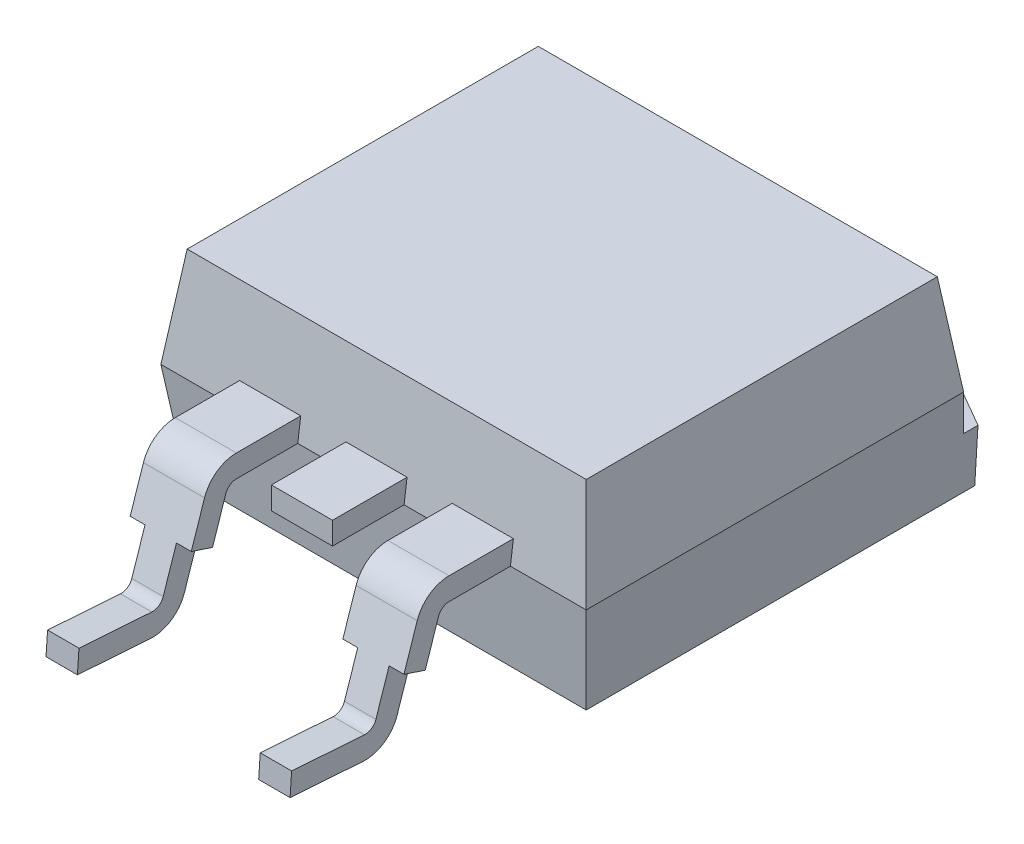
from build123d import *

# Parameters (mm, degrees)
SKETCH1_W                  = 10.16
SKETCH1_H                  = 9.015
EXTRUDE1_DEPTH             = 2.385
EXTRUDE1_TAPER             = 7.5
EXTRUDE1_OTHER_WAY_DEPTH   = 2.385
EXTRUDE1_OTHER_WAY_TAPER   = 7.5
EXTRUDE2_REACH             = 9.198
EXTRUDE2_DIRECTION_2_REACH = 9.198
CUT_EXTRUDE5_REACH         = 11.097
EXTRUDE5_DEPTH             = 0.73
SKETCH29_W                 = 1.78
SKETCH29_H                 = 0.535
EXTRUDE6_DEPTH             = 0.73
CUT_EXTRUDE8_REACH         = 20.49
SKETCH34_W                 = 0.355
SKETCH34_H                 = 2.212694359


with BuildPart() as part:
    # Sketch1 → Extrude1 (new body)
    with BuildSketch(Plane(origin=(0, 0, 0), x_dir=(1, 0, 0), z_dir=(0, 1, 0))):
        Rectangle(SKETCH1_W, SKETCH1_H)
    extrude(amount=EXTRUDE1_DEPTH, taper=EXTRUDE1_TAPER)

    # Sketch1 → Extrude1 other way (add)
    with BuildSketch(Plane(origin=(0, 0, 0), x_dir=(1, 0, 0), z_dir=(0, 1, 0))):
        Rectangle(SKETCH1_W, SKETCH1_H)
    extrude(amount=-EXTRUDE1_OTHER_WAY_DEPTH, taper=EXTRUDE1_OTHER_WAY_TAPER)

    # Extrude2: up to this plane
    extrude2_end = Plane(origin=(5.08, 0, -4.5075), z_dir=(0.9914448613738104, -0.13052619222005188, 0))
    # Sketch2 → Extrude2 (add, up to the surface)
    with BuildSketch(Plane(origin=(0, 0, 0), x_dir=(0, 0, -1), z_dir=(1, 0, 0)), mode=Mode.PRIVATE) as extrude2_sk1:
        Polygon((4.5075, 0), (4.193508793, -2.385), (5.8475, -2.385), (5.8475, -0.99), (4.637835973, -0.99), align=None)
    extrude2_tool1 = split(extrude(extrude2_sk1.sketch, amount=EXTRUDE2_REACH, mode=Mode.PRIVATE), bisect_by=extrude2_end, keep=Keep.BOTH, mode=Mode.PRIVATE)
    add(extrude2_tool1.solids().sort_by_distance((0, -1.642965, -5.034325))[0])

    # Extrude2 direction 2: up to this plane
    extrude2_direction_2_end = Plane(origin=(-5.08, 0, -4.5075), z_dir=(-0.9914448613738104, -0.13052619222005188, 0))
    # Sketch2 → Extrude2 direction 2 (add, up to the surface)
    with BuildSketch(Plane(origin=(0, 0, 0), x_dir=(0, 0, -1), z_dir=(1, 0, 0)), mode=Mode.PRIVATE) as extrude2_direction_2_sk1:
        Polygon((4.5075, 0), (4.193508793, -2.385), (5.8475, -2.385), (5.8475, -0.99), (4.637835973, -0.99), align=None)
    extrude2_direction_2_tool1 = split(extrude(extrude2_direction_2_sk1.sketch, amount=-EXTRUDE2_DIRECTION_2_REACH, mode=Mode.PRIVATE), bisect_by=extrude2_direction_2_end, keep=Keep.BOTH, mode=Mode.PRIVATE)
    add(extrude2_direction_2_tool1.solids().sort_by_distance((0, -1.642965, -5.034325))[0])

    # Sketch27 → Cut-Extrude5 (cut, up to next)
    with BuildSketch(Plane(origin=(0, 2.385, 0), x_dir=(1, 0, 0), z_dir=(0, 1, 0)), mode=Mode.PRIVATE) as cut_extrude5_sk1:
        Polygon((3.449664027, 5.8475), (4.949664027, 5.8475), (4.949664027, 4.981474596), align=None)
    cut_extrude5_tool1 = extrude(cut_extrude5_sk1.sketch, amount=-CUT_EXTRUDE5_REACH, mode=Mode.PRIVATE) & part.part
    # Sketch27 → Cut-Extrude5 (cut, up to next)
    with BuildSketch(Plane(origin=(0, 2.385, 0), x_dir=(1, 0, 0), z_dir=(0, 1, 0)), mode=Mode.PRIVATE) as cut_extrude5_sk2:
        Polygon((-4.949664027, 4.981474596), (-3.449664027, 5.8475), (-4.949664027, 5.8475), align=None)
    cut_extrude5_tool2 = extrude(cut_extrude5_sk2.sketch, amount=-CUT_EXTRUDE5_REACH, mode=Mode.PRIVATE) & part.part
    add(cut_extrude5_tool1.solids().sort_by_distance((4.449664, 2.385, -5.558825))[0], mode=Mode.SUBTRACT)
    add(cut_extrude5_tool2.solids().sort_by_distance((-4.449664, 2.385, -5.558825))[0], mode=Mode.SUBTRACT)

    # Sketch28 → Extrude5 (add, symmetric)
    with BuildSketch(Plane(origin=(2.54, 0, 0), x_dir=(0, 0, -1), z_dir=(1, 0, 0))):
        with BuildLine():
            Line((-4.437065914, 0.535), (-5.972851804, 0.535))
            ThreePointArc((-5.972851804, 0.535), (-6.442417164, 0.383280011), (-6.734431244, -0.014511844))
            Line((-6.734431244, -0.014511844), (-7.366359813, -1.916829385))
            ThreePointArc((-7.366359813, -1.916829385), (-7.47136382, -2.054757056), (-7.638879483, -2.099348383))
            Line((-7.638879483, -2.099348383), (-9.378840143, -1.977678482))
            Line((-9.378840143, -1.977678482), (-9.416159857, -2.511375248))
            Line((-9.416159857, -2.511375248), (-7.676199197, -2.63304515))
            ThreePointArc((-7.676199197, -2.63304515), (-7.173652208, -2.499271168), (-6.858640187, -2.085488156))
            Line((-6.858640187, -2.085488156), (-6.226711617, -0.183170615))
            ThreePointArc((-6.226711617, -0.183170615), (-6.129373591, -0.05057333), (-5.972851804, 0))
            Line((-5.972851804, 0), (-4.437065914, 0))
            Line((-4.437065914, 0), (-4.437065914, 0.535))
        make_face()
    extrude5 = extrude(amount=EXTRUDE5_DEPTH, both=True)

    # Sketch29 → Extrude6 (add, symmetric)
    with BuildSketch(Plane(origin=(0, 0, 0), x_dir=(0, 0, -1), z_dir=(1, 0, 0))):
        with Locations((-5.327065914, 0.2675)):
            Rectangle(SKETCH29_W, SKETCH29_H)
    extrude(amount=EXTRUDE6_DEPTH, both=True)

    # Mirror1: Extrude5 across plane
    add(extrude5.mirror(Plane(origin=(0, 0, 0), x_dir=(0, 0, 1), z_dir=(1, 0, 0))))

    # Sketch34 → Cut-Extrude8 (cut, up to next)
    with BuildSketch(Plane(origin=(0, 3.589581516, 10.805847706), x_dir=(1, 0, 0), z_dir=(0, 0.3152500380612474, 0.9490086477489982)), mode=Mode.PRIVATE) as cut_extrude8_sk1:
        with Locations((3.0925, -4.245414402)):
            Rectangle(SKETCH34_W, SKETCH34_H)
    cut_extrude8_tool1 = extrude(cut_extrude8_sk1.sketch, amount=-CUT_EXTRUDE8_REACH, mode=Mode.PRIVATE) & part.part
    # Sketch34 → Cut-Extrude8 (cut, up to next)
    with BuildSketch(Plane(origin=(0, 3.589581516, 10.805847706), x_dir=(1, 0, 0), z_dir=(0, 0.3152500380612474, 0.9490086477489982)), mode=Mode.PRIVATE) as cut_extrude8_sk2:
        with Locations((1.9875, -4.245414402)):
            Rectangle(SKETCH34_W, SKETCH34_H)
    cut_extrude8_tool2 = extrude(cut_extrude8_sk2.sketch, amount=-CUT_EXTRUDE8_REACH, mode=Mode.PRIVATE) & part.part
    cut_extrude8_1 = cut_extrude8_tool1.solids().sort_by_distance((3.0925, -0.439353, 12.144215))[0]
    add(cut_extrude8_1, mode=Mode.SUBTRACT)
    cut_extrude8_2 = cut_extrude8_tool2.solids().sort_by_distance((1.9875, -0.439353, 12.144215))[0]
    add(cut_extrude8_2, mode=Mode.SUBTRACT)
    cut_extrude8 = cut_extrude8_1 + cut_extrude8_2  # Cut-Extrude8 as one shape, for the pattern or mirror that repeats it

    # Mirror2: Cut-Extrude8 across plane
    add(cut_extrude8.mirror(Plane(origin=(0, 0, 0), x_dir=(0, 0, 1), z_dir=(1, 0, 0))), mode=Mode.SUBTRACT)


solid = part.part
